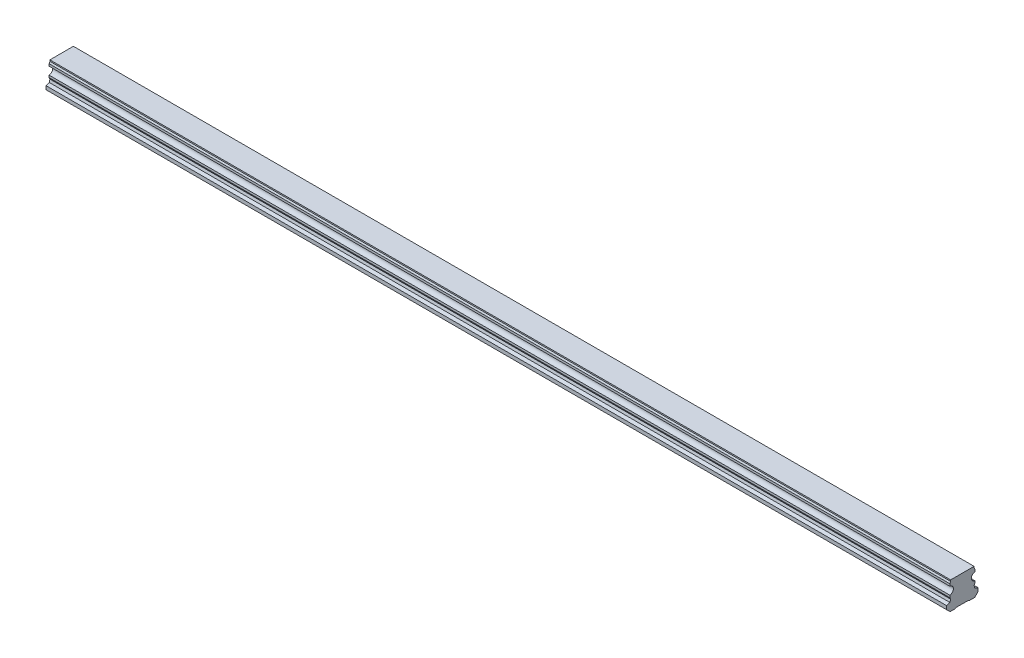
from build123d import *

# Parameters (mm, degrees)
BOSS_EXTRUDE1_DEPTH        = 720
SKETCH3_R                  = 3
SKETCH3_R_2                = 2.5
CUT_EXTRUDE3_DEPTH         = 12
SKETCH3_2_R                = 2.5
CUT_EXTRUDE4_DEPTH         = 15
CHAMFER1_SIZE              = 0.5
LPATTERN4_COUNT            = 12
LPATTERN4_PITCH            = 60
CHAMFER1_OF_LPATTERN4_SIZE = 0.5


with BuildPart() as part:
    # Sketch1 → Boss-Extrude1 (new body)
    with BuildSketch(Plane(origin=(0, 0, 0), x_dir=(0, 0, -1), z_dir=(1, 0, 0))):
        with BuildLine():
            Line((9.375, 21.8), (-9.375, 21.8))
            Line((-9.375, 21.8), (-9.375, 20.756))
            Line((-9.375, 20.756), (-10, 19.415683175))
            Line((-10, 19.415683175), (-10, 17.685449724))
            ThreePointArc((-10, 17.685449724), (-7.2, 14.6), (-10, 11.514550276))
            Line((-10, 11.514550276), (-10, 9.784316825))
            Line((-10, 9.784316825), (-9.375, 8.444))
            Line((-9.375, 8.444), (-9.922688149, 6.4))
            Line((-9.922688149, 6.4), (-12.5, 5.489338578))
            Line((-12.5, 5.489338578), (-12.5, 2.65))
            Line((-12.5, 2.65), (-9.85, 0))
            Line((-9.85, 0), (-5.5, 0))
            Line((-5.5, 0), (-5, 0.5))
            Line((-5, 0.5), (5, 0.5))
            Line((5, 0.5), (5.5, 0))
            Line((5.5, 0), (9.85, 0))
            Line((9.85, 0), (12.5, 2.65))
            Line((12.5, 2.65), (12.5, 5.489338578))
            Line((12.5, 5.489338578), (9.922688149, 6.4))
            Line((9.922688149, 6.4), (9.375, 8.444))
            Line((9.375, 8.444), (10, 9.784316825))
            Line((10, 9.784316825), (10, 11.514550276))
            ThreePointArc((10, 11.514550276), (7.2, 14.6), (10, 17.685449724))
            Line((10, 17.685449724), (10, 19.415683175))
            Line((10, 19.415683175), (9.375, 20.756))
            Line((9.375, 20.756), (9.375, 21.8))
        make_face()
    extrude(amount=BOSS_EXTRUDE1_DEPTH)

    # Sketch3 → Cut-Extrude3 (cut)
    with BuildSketch(Plane.XZ):
        with Locations(Location((30, 0, 0), (0, 0, 270))):
            Circle(SKETCH3_R)
        with Locations(Location((30, 0, 0), (0, 0, 270))):
            Circle(SKETCH3_R_2, mode=Mode.SUBTRACT)
    cut_extrude3 = extrude(amount=-CUT_EXTRUDE3_DEPTH, mode=Mode.SUBTRACT)

    # Sketch3_2 → Cut-Extrude4 (cut)
    with BuildSketch(Plane.XZ):
        with Locations(Location((30, 0, 0), (0, 0, 270))):
            Circle(SKETCH3_2_R)
    cut_extrude4 = extrude(amount=-CUT_EXTRUDE4_DEPTH, mode=Mode.SUBTRACT)

    # Cut-Extrude5 cone 1 section (on through the dimple's axis) → Cut-Extrude5 (revolve, cut)
    with BuildSketch(Plane(origin=(30, 15, 0), x_dir=(0, 0, -1), z_dir=(1, 0, 0))):
        Polygon((0, 0), (2.5, 0), (0, 1.443375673), align=None)
    cut_extrude5 = revolve(axis=Axis((30, 15, 0), (0, 1, 0)), mode=Mode.SUBTRACT)

    # Chamfer1
    chamfer1_edges = [part.edges().sort_by_distance(p)[0] for p in [
        (30, 0.5, 3),
    ]]
    chamfer(chamfer1_edges, length=CHAMFER1_SIZE)

    # LPattern4: Cut-Extrude3, Cut-Extrude4, Cut-Extrude5 ×12
    with Locations(*[(i * LPATTERN4_PITCH, 0, 0) for i in range(1, LPATTERN4_COUNT)]):
        add(cut_extrude3, mode=Mode.SUBTRACT)
        add(cut_extrude4, mode=Mode.SUBTRACT)
        add(cut_extrude5, mode=Mode.SUBTRACT)

    # Chamfer1 of LPattern4
    chamfer1_of_lpattern4_edges = [part.edges().sort_by_distance(p)[0] for p in [
        (90, 0.5, 3),
        (150, 0.5, 3),
        (210, 0.5, 3),
        (270, 0.5, 3),
        (330, 0.5, 3),
        (390, 0.5, 3),
        (450, 0.5, 3),
        (510, 0.5, 3),
        (570, 0.5, 3),
        (630, 0.5, 3),
        (690, 0.5, 3),
    ]]
    chamfer(chamfer1_of_lpattern4_edges, length=CHAMFER1_OF_LPATTERN4_SIZE)


solid = part.part
